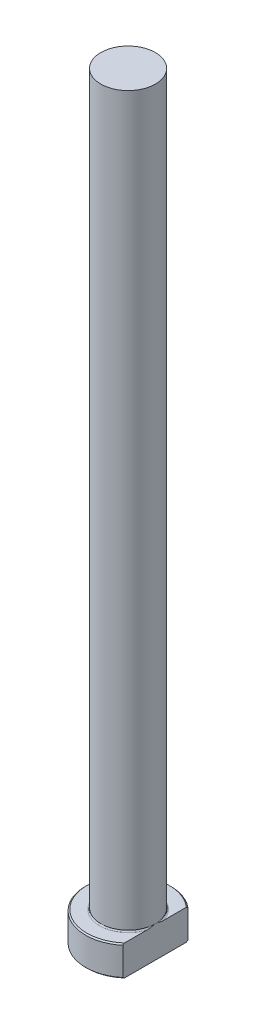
from build123d import *
from build123d.topology import SkipClean

# Parameters (mm, degrees)
CHAMFER1_SIZE = 0.2
FILLET1_R     = 0.2
KEY_DEPTH     = 126.391387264


with BuildPart() as part:
    # Sketch1 → Revolve1 (revolve)
    with BuildSketch(Plane.XY, mode=Mode.PRIVATE) as revolve1_sk:
        Polygon((0, 0), (-7, 0), (-7, 5), (-4.5, 5), (-4.5, 125), (0, 125), align=None)
    revolve(revolve1_sk.sketch.rotate(Axis((0, 259.958771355, 0), (0, -1, 0)), 270), axis=Axis((0, 259.958771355, 0), (0, -1, 0)))

    # Chamfer1
    chamfer1_edges = [part.edges().sort_by_distance(p)[0] for p in [
        (0, 5, -7),
        (0, 0, -7),
    ]]
    chamfer(chamfer1_edges, length=CHAMFER1_SIZE)

    # Fillet1
    fillet1_edges = [part.edges().sort_by_distance(p)[0] for p in [
        (0, 5, -4.5),
    ]]
    fillet(fillet1_edges, radius=FILLET1_R)

    # Sketch2 → KEY (cut, through all)
    with SkipClean():  # the faces are left unmerged after this step: merging them gives an invalid solid
        with BuildSketch(Plane(origin=(0, 0, 0), x_dir=(1, 0, 0), z_dir=(0, 1, 0))):
            with BuildLine():
                Line((4.5, 5.361902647), (4.5, -5.361902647))
                ThreePointArc((4.5, -5.361902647), (7, 0), (4.5, 5.361902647))
            make_face()
        extrude(amount=KEY_DEPTH, mode=Mode.SUBTRACT)


solid = part.part
